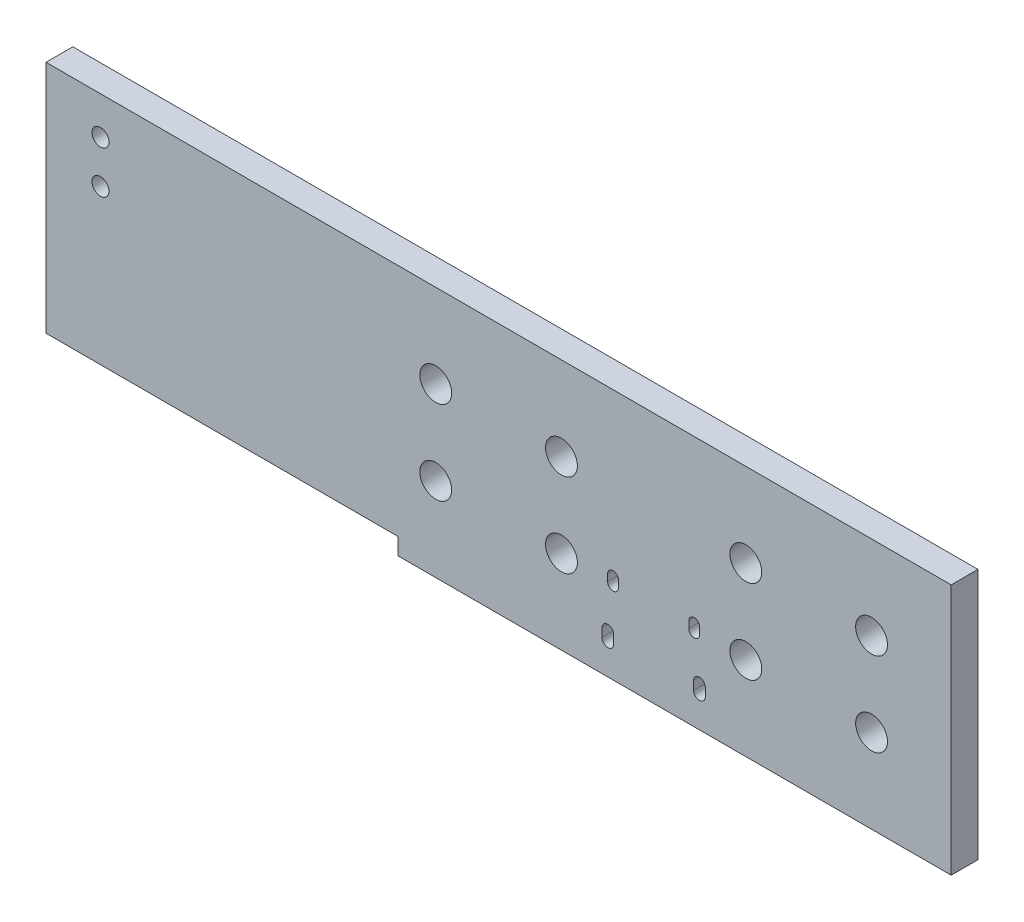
ISO-10303-21;
HEADER;
FILE_DESCRIPTION(('STEP AP214'),'2;1');
FILE_NAME('part.step','',(''),(''),'','','');
FILE_SCHEMA(('AUTOMOTIVE_DESIGN { 1 0 10303 214 1 1 1 1 }'));
ENDSEC;
DATA;
#1=APPLICATION_CONTEXT('core data for automotive mechanical design processes');
#2=APPLICATION_PROTOCOL_DEFINITION('international standard','automotive_design',2000,#1);
#3=PRODUCT_CONTEXT('',#1,'mechanical');
#4=PRODUCT('Part','Part','',(#3));
#5=PRODUCT_RELATED_PRODUCT_CATEGORY('part','',(#4));
#6=PRODUCT_DEFINITION_FORMATION('','',#4);
#7=PRODUCT_DEFINITION_CONTEXT('part definition',#1,'design');
#8=PRODUCT_DEFINITION('design','',#6,#7);
#9=PRODUCT_DEFINITION_SHAPE('','',#8);
#10=(LENGTH_UNIT() NAMED_UNIT(*) SI_UNIT(.MILLI.,.METRE.));
#11=(NAMED_UNIT(*) PLANE_ANGLE_UNIT() SI_UNIT($,.RADIAN.));
#12=(NAMED_UNIT(*) SI_UNIT($,.STERADIAN.) SOLID_ANGLE_UNIT());
#13=UNCERTAINTY_MEASURE_WITH_UNIT(LENGTH_MEASURE(1.E-05),#10,'distance_accuracy_value','');
#14=(GEOMETRIC_REPRESENTATION_CONTEXT(3) GLOBAL_UNCERTAINTY_ASSIGNED_CONTEXT((#13)) GLOBAL_UNIT_ASSIGNED_CONTEXT((#10,
#11,#12)) REPRESENTATION_CONTEXT('',''));
#15=CARTESIAN_POINT('',(0.,0.,0.));
#16=DIRECTION('',(0.,0.,1.));
#17=DIRECTION('',(1.,0.,0.));
#18=AXIS2_PLACEMENT_3D('',#15,#16,#17);
#19=CARTESIAN_POINT('',(147.505,-109.93,0.));
#20=DIRECTION('',(-1.,0.,0.));
#21=DIRECTION('',(0.,-1.,0.));
#22=AXIS2_PLACEMENT_3D('',#19,#20,#21);
#23=PLANE('',#22);
#24=DIRECTION('',(0.,0.,1.));
#25=VECTOR('',#24,1.);
#26=CARTESIAN_POINT('',(147.505,-110.33,0.));
#27=LINE('',#26,#25);
#28=CARTESIAN_POINT('',(147.505,-110.33,0.));
#29=VERTEX_POINT('',#28);
#30=CARTESIAN_POINT('',(147.505,-110.33,-1.6));
#31=VERTEX_POINT('',#30);
#32=EDGE_CURVE('E141',#29,#31,#27,.F.);
#33=ORIENTED_EDGE('',*,*,#32,.T.);
#34=DIRECTION('',(0.,-1.,0.));
#35=VECTOR('',#34,1.);
#36=CARTESIAN_POINT('',(147.505,-109.93,-1.6));
#37=LINE('',#36,#35);
#38=CARTESIAN_POINT('',(147.505,-109.93,-1.6));
#39=VERTEX_POINT('',#38);
#40=EDGE_CURVE('E163',#39,#31,#37,.T.);
#41=ORIENTED_EDGE('',*,*,#40,.F.);
#42=DIRECTION('',(0.,0.,1.));
#43=VECTOR('',#42,1.);
#44=CARTESIAN_POINT('',(147.505,-109.93,0.));
#45=LINE('',#44,#43);
#46=CARTESIAN_POINT('',(147.505,-109.93,0.));
#47=VERTEX_POINT('',#46);
#48=EDGE_CURVE('E124',#39,#47,#45,.T.);
#49=ORIENTED_EDGE('',*,*,#48,.T.);
#50=DIRECTION('',(0.,-1.,0.));
#51=VECTOR('',#50,1.);
#52=CARTESIAN_POINT('',(147.505,-109.93,0.));
#53=LINE('',#52,#51);
#54=EDGE_CURVE('E156',#29,#47,#53,.F.);
#55=ORIENTED_EDGE('',*,*,#54,.F.);
#56=EDGE_LOOP('',(#33,#41,#49,#55));
#57=FACE_BOUND('',#56,.T.);
#58=ADVANCED_FACE('F16',(#57),#23,.F.);
#59=CARTESIAN_POINT('',(153.33,-113.38,0.));
#60=DIRECTION('',(1.,0.,0.));
#61=DIRECTION('',(0.,1.,0.));
#62=AXIS2_PLACEMENT_3D('',#59,#60,#61);
#63=PLANE('',#62);
#64=DIRECTION('',(0.,0.,1.));
#65=VECTOR('',#64,1.);
#66=CARTESIAN_POINT('',(153.33,-112.88,0.));
#67=LINE('',#66,#65);
#68=CARTESIAN_POINT('',(153.33,-112.88,0.));
#69=VERTEX_POINT('',#68);
#70=CARTESIAN_POINT('',(153.33,-112.88,-1.6));
#71=VERTEX_POINT('',#70);
#72=EDGE_CURVE('E150',#69,#71,#67,.F.);
#73=ORIENTED_EDGE('',*,*,#72,.T.);
#74=DIRECTION('',(0.,1.,0.));
#75=VECTOR('',#74,1.);
#76=CARTESIAN_POINT('',(153.33,-113.38,-1.6));
#77=LINE('',#76,#75);
#78=CARTESIAN_POINT('',(153.33,-113.38,-1.6));
#79=VERTEX_POINT('',#78);
#80=EDGE_CURVE('E153',#79,#71,#77,.T.);
#81=ORIENTED_EDGE('',*,*,#80,.F.);
#82=DIRECTION('',(0.,0.,1.));
#83=VECTOR('',#82,1.);
#84=CARTESIAN_POINT('',(153.33,-113.38,0.));
#85=LINE('',#84,#83);
#86=CARTESIAN_POINT('',(153.33,-113.38,0.));
#87=VERTEX_POINT('',#86);
#88=EDGE_CURVE('E147',#79,#87,#85,.T.);
#89=ORIENTED_EDGE('',*,*,#88,.T.);
#90=DIRECTION('',(0.,1.,0.));
#91=VECTOR('',#90,1.);
#92=CARTESIAN_POINT('',(153.33,-113.38,0.));
#93=LINE('',#92,#91);
#94=EDGE_CURVE('E144',#69,#87,#93,.F.);
#95=ORIENTED_EDGE('',*,*,#94,.F.);
#96=EDGE_LOOP('',(#73,#81,#89,#95));
#97=FACE_BOUND('',#96,.T.);
#98=ADVANCED_FACE('F437',(#97),#63,.F.);
#99=CARTESIAN_POINT('',(147.87,-113.38,0.));
#100=DIRECTION('',(1.,0.,0.));
#101=DIRECTION('',(0.,1.,0.));
#102=AXIS2_PLACEMENT_3D('',#99,#100,#101);
#103=PLANE('',#102);
#104=DIRECTION('',(0.,0.,1.));
#105=VECTOR('',#104,1.);
#106=CARTESIAN_POINT('',(147.87,-112.88,0.));
#107=LINE('',#106,#105);
#108=CARTESIAN_POINT('',(147.87,-112.88,0.));
#109=VERTEX_POINT('',#108);
#110=CARTESIAN_POINT('',(147.87,-112.88,-1.6));
#111=VERTEX_POINT('',#110);
#112=EDGE_CURVE('E137',#109,#111,#107,.F.);
#113=ORIENTED_EDGE('',*,*,#112,.T.);
#114=DIRECTION('',(0.,1.,0.));
#115=VECTOR('',#114,1.);
#116=CARTESIAN_POINT('',(147.87,-113.38,-1.6));
#117=LINE('',#116,#115);
#118=CARTESIAN_POINT('',(147.87,-113.38,-1.6));
#119=VERTEX_POINT('',#118);
#120=EDGE_CURVE('E142',#119,#111,#117,.T.);
#121=ORIENTED_EDGE('',*,*,#120,.F.);
#122=DIRECTION('',(0.,0.,1.));
#123=VECTOR('',#122,1.);
#124=CARTESIAN_POINT('',(147.87,-113.38,0.));
#125=LINE('',#124,#123);
#126=CARTESIAN_POINT('',(147.87,-113.38,0.));
#127=VERTEX_POINT('',#126);
#128=EDGE_CURVE('E133',#119,#127,#125,.T.);
#129=ORIENTED_EDGE('',*,*,#128,.T.);
#130=DIRECTION('',(0.,1.,0.));
#131=VECTOR('',#130,1.);
#132=CARTESIAN_POINT('',(147.87,-113.38,0.));
#133=LINE('',#132,#131);
#134=EDGE_CURVE('E138',#109,#127,#133,.F.);
#135=ORIENTED_EDGE('',*,*,#134,.F.);
#136=EDGE_LOOP('',(#113,#121,#129,#135));
#137=FACE_BOUND('',#136,.T.);
#138=ADVANCED_FACE('F456',(#137),#103,.F.);
#139=CARTESIAN_POINT('',(152.995,-110.33,0.));
#140=DIRECTION('',(1.,0.,0.));
#141=DIRECTION('',(0.,1.,0.));
#142=AXIS2_PLACEMENT_3D('',#139,#140,#141);
#143=PLANE('',#142);
#144=DIRECTION('',(0.,0.,1.));
#145=VECTOR('',#144,1.);
#146=CARTESIAN_POINT('',(152.995,-109.93,0.));
#147=LINE('',#146,#145);
#148=CARTESIAN_POINT('',(152.995,-109.93,0.));
#149=VERTEX_POINT('',#148);
#150=CARTESIAN_POINT('',(152.995,-109.93,-1.6));
#151=VERTEX_POINT('',#150);
#152=EDGE_CURVE('E128',#149,#151,#147,.F.);
#153=ORIENTED_EDGE('',*,*,#152,.T.);
#154=DIRECTION('',(0.,1.,0.));
#155=VECTOR('',#154,1.);
#156=CARTESIAN_POINT('',(152.995,-110.33,-1.6));
#157=LINE('',#156,#155);
#158=CARTESIAN_POINT('',(152.995,-110.33,-1.6));
#159=VERTEX_POINT('',#158);
#160=EDGE_CURVE('E113',#159,#151,#157,.T.);
#161=ORIENTED_EDGE('',*,*,#160,.F.);
#162=DIRECTION('',(0.,0.,1.));
#163=VECTOR('',#162,1.);
#164=CARTESIAN_POINT('',(152.995,-110.33,0.));
#165=LINE('',#164,#163);
#166=CARTESIAN_POINT('',(152.995,-110.33,0.));
#167=VERTEX_POINT('',#166);
#168=EDGE_CURVE('E120',#167,#159,#165,.F.);
#169=ORIENTED_EDGE('',*,*,#168,.F.);
#170=DIRECTION('',(0.,1.,0.));
#171=VECTOR('',#170,1.);
#172=CARTESIAN_POINT('',(152.995,-110.33,0.));
#173=LINE('',#172,#171);
#174=EDGE_CURVE('E118',#149,#167,#173,.F.);
#175=ORIENTED_EDGE('',*,*,#174,.F.);
#176=EDGE_LOOP('',(#153,#161,#169,#175));
#177=FACE_BOUND('',#176,.T.);
#178=ADVANCED_FACE('F126',(#177),#143,.F.);
#179=CARTESIAN_POINT('',(152.67,-110.33,0.));
#180=DIRECTION('',(0.,0.,1.));
#181=DIRECTION('',(1.,0.,0.));
#182=AXIS2_PLACEMENT_3D('',#179,#180,#181);
#183=CYLINDRICAL_SURFACE('',#182,0.325);
#184=CARTESIAN_POINT('',(152.67,-110.33,0.));
#185=DIRECTION('',(0.,0.,1.));
#186=DIRECTION('',(1.,0.,0.));
#187=AXIS2_PLACEMENT_3D('',#184,#185,#186);
#188=CIRCLE('',#187,0.325);
#189=CARTESIAN_POINT('',(152.345,-110.33,0.));
#190=VERTEX_POINT('',#189);
#191=EDGE_CURVE('E103',#167,#190,#188,.F.);
#192=ORIENTED_EDGE('',*,*,#191,.F.);
#193=ORIENTED_EDGE('',*,*,#168,.T.);
#194=CARTESIAN_POINT('',(152.67,-110.33,-1.6));
#195=DIRECTION('',(0.,0.,1.));
#196=DIRECTION('',(1.,0.,0.));
#197=AXIS2_PLACEMENT_3D('',#194,#195,#196);
#198=CIRCLE('',#197,0.325);
#199=CARTESIAN_POINT('',(152.345,-110.33,-1.6));
#200=VERTEX_POINT('',#199);
#201=EDGE_CURVE('E19',#200,#159,#198,.T.);
#202=ORIENTED_EDGE('',*,*,#201,.F.);
#203=DIRECTION('',(0.,0.,1.));
#204=VECTOR('',#203,1.);
#205=CARTESIAN_POINT('',(152.345,-110.33,0.));
#206=LINE('',#205,#204);
#207=EDGE_CURVE('E263',#200,#190,#206,.T.);
#208=ORIENTED_EDGE('',*,*,#207,.T.);
#209=EDGE_LOOP('',(#192,#193,#202,#208));
#210=FACE_BOUND('',#209,.T.);
#211=ADVANCED_FACE('F121',(#210),#183,.F.);
#212=CARTESIAN_POINT('',(147.83,-110.33,0.));
#213=DIRECTION('',(0.,0.,1.));
#214=DIRECTION('',(1.,0.,0.));
#215=AXIS2_PLACEMENT_3D('',#212,#213,#214);
#216=CYLINDRICAL_SURFACE('',#215,0.325);
#217=DIRECTION('',(0.,0.,1.));
#218=VECTOR('',#217,1.);
#219=CARTESIAN_POINT('',(148.155,-110.33,0.));
#220=LINE('',#219,#218);
#221=CARTESIAN_POINT('',(148.155,-110.33,0.));
#222=VERTEX_POINT('',#221);
#223=CARTESIAN_POINT('',(148.155,-110.33,-1.6));
#224=VERTEX_POINT('',#223);
#225=EDGE_CURVE('E237',#222,#224,#220,.F.);
#226=ORIENTED_EDGE('',*,*,#225,.T.);
#227=CARTESIAN_POINT('',(147.83,-110.33,-1.6));
#228=DIRECTION('',(0.,0.,1.));
#229=DIRECTION('',(1.,0.,0.));
#230=AXIS2_PLACEMENT_3D('',#227,#228,#229);
#231=CIRCLE('',#230,0.325);
#232=EDGE_CURVE('E136',#31,#224,#231,.T.);
#233=ORIENTED_EDGE('',*,*,#232,.F.);
#234=ORIENTED_EDGE('',*,*,#32,.F.);
#235=CARTESIAN_POINT('',(147.83,-110.33,0.));
#236=DIRECTION('',(0.,0.,1.));
#237=DIRECTION('',(1.,0.,0.));
#238=AXIS2_PLACEMENT_3D('',#235,#236,#237);
#239=CIRCLE('',#238,0.325);
#240=EDGE_CURVE('E251',#29,#222,#239,.T.);
#241=ORIENTED_EDGE('',*,*,#240,.T.);
#242=EDGE_LOOP('',(#226,#233,#234,#241));
#243=FACE_BOUND('',#242,.T.);
#244=ADVANCED_FACE('F387',(#243),#216,.F.);
#245=CARTESIAN_POINT('',(147.83,-109.93,0.));
#246=DIRECTION('',(0.,0.,1.));
#247=DIRECTION('',(1.,0.,0.));
#248=AXIS2_PLACEMENT_3D('',#245,#246,#247);
#249=CYLINDRICAL_SURFACE('',#248,0.325);
#250=CARTESIAN_POINT('',(147.83,-109.93,0.));
#251=DIRECTION('',(0.,0.,1.));
#252=DIRECTION('',(1.,0.,0.));
#253=AXIS2_PLACEMENT_3D('',#250,#251,#252);
#254=CIRCLE('',#253,0.325);
#255=CARTESIAN_POINT('',(148.155,-109.93,0.));
#256=VERTEX_POINT('',#255);
#257=EDGE_CURVE('E254',#256,#47,#254,.T.);
#258=ORIENTED_EDGE('',*,*,#257,.T.);
#259=ORIENTED_EDGE('',*,*,#48,.F.);
#260=CARTESIAN_POINT('',(147.83,-109.93,-1.6));
#261=DIRECTION('',(0.,0.,1.));
#262=DIRECTION('',(1.,0.,0.));
#263=AXIS2_PLACEMENT_3D('',#260,#261,#262);
#264=CIRCLE('',#263,0.325);
#265=CARTESIAN_POINT('',(148.155,-109.93,-1.6));
#266=VERTEX_POINT('',#265);
#267=EDGE_CURVE('E264',#266,#39,#264,.T.);
#268=ORIENTED_EDGE('',*,*,#267,.F.);
#269=DIRECTION('',(0.,0.,1.));
#270=VECTOR('',#269,1.);
#271=CARTESIAN_POINT('',(148.155,-109.93,0.));
#272=LINE('',#271,#270);
#273=EDGE_CURVE('E293',#266,#256,#272,.T.);
#274=ORIENTED_EDGE('',*,*,#273,.T.);
#275=EDGE_LOOP('',(#258,#259,#268,#274));
#276=FACE_BOUND('',#275,.T.);
#277=ADVANCED_FACE('F394',(#276),#249,.F.);
#278=CARTESIAN_POINT('',(152.345,-109.93,0.));
#279=DIRECTION('',(-1.,0.,0.));
#280=DIRECTION('',(0.,-1.,0.));
#281=AXIS2_PLACEMENT_3D('',#278,#279,#280);
#282=PLANE('',#281);
#283=ORIENTED_EDGE('',*,*,#207,.F.);
#284=DIRECTION('',(0.,-1.,0.));
#285=VECTOR('',#284,1.);
#286=CARTESIAN_POINT('',(152.345,-109.93,-1.6));
#287=LINE('',#286,#285);
#288=CARTESIAN_POINT('',(152.345,-109.93,-1.6));
#289=VERTEX_POINT('',#288);
#290=EDGE_CURVE('E116',#289,#200,#287,.T.);
#291=ORIENTED_EDGE('',*,*,#290,.F.);
#292=DIRECTION('',(0.,0.,1.));
#293=VECTOR('',#292,1.);
#294=CARTESIAN_POINT('',(152.345,-109.93,0.));
#295=LINE('',#294,#293);
#296=CARTESIAN_POINT('',(152.345,-109.93,0.));
#297=VERTEX_POINT('',#296);
#298=EDGE_CURVE('E233',#289,#297,#295,.T.);
#299=ORIENTED_EDGE('',*,*,#298,.T.);
#300=DIRECTION('',(0.,1.,0.));
#301=VECTOR('',#300,1.);
#302=CARTESIAN_POINT('',(152.345,-115.25,0.));
#303=LINE('',#302,#301);
#304=EDGE_CURVE('E250',#297,#190,#303,.F.);
#305=ORIENTED_EDGE('',*,*,#304,.T.);
#306=EDGE_LOOP('',(#283,#291,#299,#305));
#307=FACE_BOUND('',#306,.T.);
#308=ADVANCED_FACE('F275',(#307),#282,.F.);
#309=CARTESIAN_POINT('',(152.98,-112.88,0.));
#310=DIRECTION('',(0.,0.,1.));
#311=DIRECTION('',(1.,0.,0.));
#312=AXIS2_PLACEMENT_3D('',#309,#310,#311);
#313=CYLINDRICAL_SURFACE('',#312,0.35);
#314=DIRECTION('',(0.,0.,1.));
#315=VECTOR('',#314,1.);
#316=CARTESIAN_POINT('',(152.63,-112.88,0.));
#317=LINE('',#316,#315);
#318=CARTESIAN_POINT('',(152.63,-112.88,0.));
#319=VERTEX_POINT('',#318);
#320=CARTESIAN_POINT('',(152.63,-112.88,-1.6));
#321=VERTEX_POINT('',#320);
#322=EDGE_CURVE('E226',#319,#321,#317,.F.);
#323=ORIENTED_EDGE('',*,*,#322,.T.);
#324=CARTESIAN_POINT('',(152.98,-112.88,-1.6));
#325=DIRECTION('',(0.,0.,1.));
#326=DIRECTION('',(1.,0.,0.));
#327=AXIS2_PLACEMENT_3D('',#324,#325,#326);
#328=CIRCLE('',#327,0.35);
#329=EDGE_CURVE('E261',#71,#321,#328,.T.);
#330=ORIENTED_EDGE('',*,*,#329,.F.);
#331=ORIENTED_EDGE('',*,*,#72,.F.);
#332=CARTESIAN_POINT('',(152.98,-112.88,0.));
#333=DIRECTION('',(0.,0.,1.));
#334=DIRECTION('',(1.,0.,0.));
#335=AXIS2_PLACEMENT_3D('',#332,#333,#334);
#336=CIRCLE('',#335,0.35);
#337=EDGE_CURVE('E245',#69,#319,#336,.T.);
#338=ORIENTED_EDGE('',*,*,#337,.T.);
#339=EDGE_LOOP('',(#323,#330,#331,#338));
#340=FACE_BOUND('',#339,.T.);
#341=ADVANCED_FACE('F434',(#340),#313,.F.);
#342=CARTESIAN_POINT('',(152.98,-113.38,0.));
#343=DIRECTION('',(0.,0.,1.));
#344=DIRECTION('',(1.,0.,0.));
#345=AXIS2_PLACEMENT_3D('',#342,#343,#344);
#346=CYLINDRICAL_SURFACE('',#345,0.35);
#347=CARTESIAN_POINT('',(152.98,-113.38,0.));
#348=DIRECTION('',(0.,0.,1.));
#349=DIRECTION('',(1.,0.,0.));
#350=AXIS2_PLACEMENT_3D('',#347,#348,#349);
#351=CIRCLE('',#350,0.35);
#352=CARTESIAN_POINT('',(152.63,-113.38,0.));
#353=VERTEX_POINT('',#352);
#354=EDGE_CURVE('E248',#353,#87,#351,.T.);
#355=ORIENTED_EDGE('',*,*,#354,.T.);
#356=ORIENTED_EDGE('',*,*,#88,.F.);
#357=CARTESIAN_POINT('',(152.98,-113.38,-1.6));
#358=DIRECTION('',(0.,0.,1.));
#359=DIRECTION('',(1.,0.,0.));
#360=AXIS2_PLACEMENT_3D('',#357,#358,#359);
#361=CIRCLE('',#360,0.35);
#362=CARTESIAN_POINT('',(152.63,-113.38,-1.6));
#363=VERTEX_POINT('',#362);
#364=EDGE_CURVE('E259',#363,#79,#361,.T.);
#365=ORIENTED_EDGE('',*,*,#364,.F.);
#366=DIRECTION('',(0.,0.,1.));
#367=VECTOR('',#366,1.);
#368=CARTESIAN_POINT('',(152.63,-113.38,0.));
#369=LINE('',#368,#367);
#370=EDGE_CURVE('E288',#363,#353,#369,.T.);
#371=ORIENTED_EDGE('',*,*,#370,.T.);
#372=EDGE_LOOP('',(#355,#356,#365,#371));
#373=FACE_BOUND('',#372,.T.);
#374=ADVANCED_FACE('F422',(#373),#346,.F.);
#375=CARTESIAN_POINT('',(147.52,-112.88,0.));
#376=DIRECTION('',(0.,0.,1.));
#377=DIRECTION('',(1.,0.,0.));
#378=AXIS2_PLACEMENT_3D('',#375,#376,#377);
#379=CYLINDRICAL_SURFACE('',#378,0.35);
#380=DIRECTION('',(0.,0.,1.));
#381=VECTOR('',#380,1.);
#382=CARTESIAN_POINT('',(147.17,-112.88,0.));
#383=LINE('',#382,#381);
#384=CARTESIAN_POINT('',(147.17,-112.88,0.));
#385=VERTEX_POINT('',#384);
#386=CARTESIAN_POINT('',(147.17,-112.88,-1.6));
#387=VERTEX_POINT('',#386);
#388=EDGE_CURVE('E287',#385,#387,#383,.F.);
#389=ORIENTED_EDGE('',*,*,#388,.T.);
#390=CARTESIAN_POINT('',(147.52,-112.88,-1.6));
#391=DIRECTION('',(0.,0.,1.));
#392=DIRECTION('',(1.,0.,0.));
#393=AXIS2_PLACEMENT_3D('',#390,#391,#392);
#394=CIRCLE('',#393,0.35);
#395=EDGE_CURVE('E34',#111,#387,#394,.T.);
#396=ORIENTED_EDGE('',*,*,#395,.F.);
#397=ORIENTED_EDGE('',*,*,#112,.F.);
#398=CARTESIAN_POINT('',(147.52,-112.88,0.));
#399=DIRECTION('',(0.,0.,1.));
#400=DIRECTION('',(1.,0.,0.));
#401=AXIS2_PLACEMENT_3D('',#398,#399,#400);
#402=CIRCLE('',#401,0.35);
#403=EDGE_CURVE('E239',#109,#385,#402,.T.);
#404=ORIENTED_EDGE('',*,*,#403,.T.);
#405=EDGE_LOOP('',(#389,#396,#397,#404));
#406=FACE_BOUND('',#405,.T.);
#407=ADVANCED_FACE('F458',(#406),#379,.F.);
#408=CARTESIAN_POINT('',(147.52,-113.38,0.));
#409=DIRECTION('',(0.,0.,1.));
#410=DIRECTION('',(1.,0.,0.));
#411=AXIS2_PLACEMENT_3D('',#408,#409,#410);
#412=CYLINDRICAL_SURFACE('',#411,0.35);
#413=CARTESIAN_POINT('',(147.52,-113.38,0.));
#414=DIRECTION('',(0.,0.,1.));
#415=DIRECTION('',(1.,0.,0.));
#416=AXIS2_PLACEMENT_3D('',#413,#414,#415);
#417=CIRCLE('',#416,0.35);
#418=CARTESIAN_POINT('',(147.17,-113.38,0.));
#419=VERTEX_POINT('',#418);
#420=EDGE_CURVE('E243',#419,#127,#417,.T.);
#421=ORIENTED_EDGE('',*,*,#420,.T.);
#422=ORIENTED_EDGE('',*,*,#128,.F.);
#423=CARTESIAN_POINT('',(147.52,-113.38,-1.6));
#424=DIRECTION('',(0.,0.,1.));
#425=DIRECTION('',(1.,0.,0.));
#426=AXIS2_PLACEMENT_3D('',#423,#424,#425);
#427=CIRCLE('',#426,0.35);
#428=CARTESIAN_POINT('',(147.17,-113.38,-1.6));
#429=VERTEX_POINT('',#428);
#430=EDGE_CURVE('E256',#429,#119,#427,.T.);
#431=ORIENTED_EDGE('',*,*,#430,.F.);
#432=DIRECTION('',(0.,0.,1.));
#433=VECTOR('',#432,1.);
#434=CARTESIAN_POINT('',(147.17,-113.38,0.));
#435=LINE('',#434,#433);
#436=EDGE_CURVE('E283',#429,#419,#435,.T.);
#437=ORIENTED_EDGE('',*,*,#436,.T.);
#438=EDGE_LOOP('',(#421,#422,#431,#437));
#439=FACE_BOUND('',#438,.T.);
#440=ADVANCED_FACE('F450',(#439),#412,.F.);
#441=CARTESIAN_POINT('',(135.,-115.25,0.));
#442=DIRECTION('',(0.,0.,-1.));
#443=DIRECTION('',(-1.,0.,0.));
#444=AXIS2_PLACEMENT_3D('',#441,#442,#443);
#445=PLANE('',#444);
#446=CARTESIAN_POINT('',(137.25,-110.25,0.));
#447=DIRECTION('',(0.,0.,1.));
#448=DIRECTION('',(1.,0.,0.));
#449=AXIS2_PLACEMENT_3D('',#446,#447,#448);
#450=CIRCLE('',#449,0.95);
#451=CARTESIAN_POINT('',(138.2,-110.25,0.));
#452=VERTEX_POINT('',#451);
#453=EDGE_CURVE('E200',#452,#452,#450,.F.);
#454=ORIENTED_EDGE('',*,*,#453,.T.);
#455=EDGE_LOOP('',(#454));
#456=FACE_BOUND('',#455,.T.);
#457=CARTESIAN_POINT('',(137.25,-105.25,0.));
#458=DIRECTION('',(0.,0.,1.));
#459=DIRECTION('',(1.,0.,0.));
#460=AXIS2_PLACEMENT_3D('',#457,#458,#459);
#461=CIRCLE('',#460,0.95);
#462=CARTESIAN_POINT('',(138.2,-105.25,0.));
#463=VERTEX_POINT('',#462);
#464=EDGE_CURVE('E204',#463,#463,#461,.F.);
#465=ORIENTED_EDGE('',*,*,#464,.T.);
#466=EDGE_LOOP('',(#465));
#467=FACE_BOUND('',#466,.T.);
#468=CARTESIAN_POINT('',(117.25,-105.04,0.));
#469=DIRECTION('',(0.,0.,1.));
#470=DIRECTION('',(1.,0.,0.));
#471=AXIS2_PLACEMENT_3D('',#468,#469,#470);
#472=CIRCLE('',#471,0.508);
#473=CARTESIAN_POINT('',(117.758,-105.04,0.));
#474=VERTEX_POINT('',#473);
#475=EDGE_CURVE('E207',#474,#474,#472,.F.);
#476=ORIENTED_EDGE('',*,*,#475,.T.);
#477=EDGE_LOOP('',(#476));
#478=FACE_BOUND('',#477,.T.);
#479=CARTESIAN_POINT('',(117.25,-102.5,0.));
#480=DIRECTION('',(0.,0.,1.));
#481=DIRECTION('',(1.,0.,0.));
#482=AXIS2_PLACEMENT_3D('',#479,#480,#481);
#483=CIRCLE('',#482,0.508);
#484=CARTESIAN_POINT('',(117.758,-102.5,0.));
#485=VERTEX_POINT('',#484);
#486=EDGE_CURVE('E210',#485,#485,#483,.F.);
#487=ORIENTED_EDGE('',*,*,#486,.T.);
#488=EDGE_LOOP('',(#487));
#489=FACE_BOUND('',#488,.T.);
#490=CARTESIAN_POINT('',(155.75,-105.25,0.));
#491=DIRECTION('',(0.,0.,1.));
#492=DIRECTION('',(1.,0.,0.));
#493=AXIS2_PLACEMENT_3D('',#490,#491,#492);
#494=CIRCLE('',#493,0.95);
#495=CARTESIAN_POINT('',(156.7,-105.25,0.));
#496=VERTEX_POINT('',#495);
#497=EDGE_CURVE('E213',#496,#496,#494,.F.);
#498=ORIENTED_EDGE('',*,*,#497,.T.);
#499=EDGE_LOOP('',(#498));
#500=FACE_BOUND('',#499,.T.);
#501=CARTESIAN_POINT('',(163.25,-105.25,0.));
#502=DIRECTION('',(0.,0.,1.));
#503=DIRECTION('',(1.,0.,0.));
#504=AXIS2_PLACEMENT_3D('',#501,#502,#503);
#505=CIRCLE('',#504,0.95);
#506=CARTESIAN_POINT('',(164.2,-105.25,0.));
#507=VERTEX_POINT('',#506);
#508=EDGE_CURVE('E216',#507,#507,#505,.F.);
#509=ORIENTED_EDGE('',*,*,#508,.T.);
#510=EDGE_LOOP('',(#509));
#511=FACE_BOUND('',#510,.T.);
#512=CARTESIAN_POINT('',(144.75,-105.25,0.));
#513=DIRECTION('',(0.,0.,1.));
#514=DIRECTION('',(1.,0.,0.));
#515=AXIS2_PLACEMENT_3D('',#512,#513,#514);
#516=CIRCLE('',#515,0.95);
#517=CARTESIAN_POINT('',(145.7,-105.25,0.));
#518=VERTEX_POINT('',#517);
#519=EDGE_CURVE('E219',#518,#518,#516,.F.);
#520=ORIENTED_EDGE('',*,*,#519,.T.);
#521=EDGE_LOOP('',(#520));
#522=FACE_BOUND('',#521,.T.);
#523=ORIENTED_EDGE('',*,*,#403,.F.);
#524=ORIENTED_EDGE('',*,*,#134,.T.);
#525=ORIENTED_EDGE('',*,*,#420,.F.);
#526=DIRECTION('',(0.,-1.,0.));
#527=VECTOR('',#526,1.);
#528=CARTESIAN_POINT('',(147.17,-112.88,0.));
#529=LINE('',#528,#527);
#530=EDGE_CURVE('E222',#419,#385,#529,.F.);
#531=ORIENTED_EDGE('',*,*,#530,.T.);
#532=EDGE_LOOP('',(#523,#524,#525,#531));
#533=FACE_BOUND('',#532,.T.);
#534=ORIENTED_EDGE('',*,*,#337,.F.);
#535=ORIENTED_EDGE('',*,*,#94,.T.);
#536=ORIENTED_EDGE('',*,*,#354,.F.);
#537=DIRECTION('',(0.,-1.,0.));
#538=VECTOR('',#537,1.);
#539=CARTESIAN_POINT('',(152.63,-112.88,0.));
#540=LINE('',#539,#538);
#541=EDGE_CURVE('E284',#353,#319,#540,.F.);
#542=ORIENTED_EDGE('',*,*,#541,.T.);
#543=EDGE_LOOP('',(#534,#535,#536,#542));
#544=FACE_BOUND('',#543,.T.);
#545=CARTESIAN_POINT('',(155.75,-110.25,0.));
#546=DIRECTION('',(0.,0.,1.));
#547=DIRECTION('',(1.,0.,0.));
#548=AXIS2_PLACEMENT_3D('',#545,#546,#547);
#549=CIRCLE('',#548,0.95);
#550=CARTESIAN_POINT('',(156.7,-110.25,0.));
#551=VERTEX_POINT('',#550);
#552=EDGE_CURVE('E223',#551,#551,#549,.F.);
#553=ORIENTED_EDGE('',*,*,#552,.T.);
#554=EDGE_LOOP('',(#553));
#555=FACE_BOUND('',#554,.T.);
#556=CARTESIAN_POINT('',(163.25,-110.25,0.));
#557=DIRECTION('',(0.,0.,1.));
#558=DIRECTION('',(1.,0.,0.));
#559=AXIS2_PLACEMENT_3D('',#556,#557,#558);
#560=CIRCLE('',#559,0.95);
#561=CARTESIAN_POINT('',(164.2,-110.25,0.));
#562=VERTEX_POINT('',#561);
#563=EDGE_CURVE('E227',#562,#562,#560,.F.);
#564=ORIENTED_EDGE('',*,*,#563,.T.);
#565=EDGE_LOOP('',(#564));
#566=FACE_BOUND('',#565,.T.);
#567=CARTESIAN_POINT('',(152.67,-109.93,0.));
#568=DIRECTION('',(0.,0.,1.));
#569=DIRECTION('',(1.,0.,0.));
#570=AXIS2_PLACEMENT_3D('',#567,#568,#569);
#571=CIRCLE('',#570,0.325);
#572=EDGE_CURVE('E230',#297,#149,#571,.F.);
#573=ORIENTED_EDGE('',*,*,#572,.T.);
#574=ORIENTED_EDGE('',*,*,#174,.T.);
#575=ORIENTED_EDGE('',*,*,#191,.T.);
#576=ORIENTED_EDGE('',*,*,#304,.F.);
#577=EDGE_LOOP('',(#573,#574,#575,#576));
#578=FACE_BOUND('',#577,.T.);
#579=ORIENTED_EDGE('',*,*,#240,.F.);
#580=ORIENTED_EDGE('',*,*,#54,.T.);
#581=ORIENTED_EDGE('',*,*,#257,.F.);
#582=DIRECTION('',(0.,1.,0.));
#583=VECTOR('',#582,1.);
#584=CARTESIAN_POINT('',(148.155,-110.33,0.));
#585=LINE('',#584,#583);
#586=EDGE_CURVE('E290',#256,#222,#585,.F.);
#587=ORIENTED_EDGE('',*,*,#586,.T.);
#588=EDGE_LOOP('',(#579,#580,#581,#587));
#589=FACE_BOUND('',#588,.T.);
#590=CARTESIAN_POINT('',(144.75,-110.25,0.));
#591=DIRECTION('',(0.,0.,1.));
#592=DIRECTION('',(1.,0.,0.));
#593=AXIS2_PLACEMENT_3D('',#590,#591,#592);
#594=CIRCLE('',#593,0.95);
#595=CARTESIAN_POINT('',(145.7,-110.25,0.));
#596=VERTEX_POINT('',#595);
#597=EDGE_CURVE('E234',#596,#596,#594,.F.);
#598=ORIENTED_EDGE('',*,*,#597,.T.);
#599=EDGE_LOOP('',(#598));
#600=FACE_BOUND('',#599,.T.);
#601=DIRECTION('',(0.,1.,0.));
#602=VECTOR('',#601,1.);
#603=CARTESIAN_POINT('',(168.,-115.25,0.));
#604=LINE('',#603,#602);
#605=CARTESIAN_POINT('',(168.,-100.25,0.));
#606=VERTEX_POINT('',#605);
#607=CARTESIAN_POINT('',(168.,-115.25,0.));
#608=VERTEX_POINT('',#607);
#609=EDGE_CURVE('E312',#606,#608,#604,.F.);
#610=ORIENTED_EDGE('',*,*,#609,.F.);
#611=DIRECTION('',(1.,0.,0.));
#612=VECTOR('',#611,1.);
#613=CARTESIAN_POINT('',(168.,-100.25,0.));
#614=LINE('',#613,#612);
#615=CARTESIAN_POINT('',(114.,-100.25,0.));
#616=VERTEX_POINT('',#615);
#617=EDGE_CURVE('E318',#616,#606,#614,.T.);
#618=ORIENTED_EDGE('',*,*,#617,.F.);
#619=DIRECTION('',(0.,1.,0.));
#620=VECTOR('',#619,1.);
#621=CARTESIAN_POINT('',(114.,-100.25,0.));
#622=LINE('',#621,#620);
#623=CARTESIAN_POINT('',(114.,-114.25,0.));
#624=VERTEX_POINT('',#623);
#625=EDGE_CURVE('E324',#624,#616,#622,.T.);
#626=ORIENTED_EDGE('',*,*,#625,.F.);
#627=DIRECTION('',(1.,0.,0.));
#628=VECTOR('',#627,1.);
#629=CARTESIAN_POINT('',(114.,-114.25,0.));
#630=LINE('',#629,#628);
#631=CARTESIAN_POINT('',(135.,-114.25,0.));
#632=VERTEX_POINT('',#631);
#633=EDGE_CURVE('E330',#632,#624,#630,.F.);
#634=ORIENTED_EDGE('',*,*,#633,.F.);
#635=DIRECTION('',(0.,1.,0.));
#636=VECTOR('',#635,1.);
#637=CARTESIAN_POINT('',(135.,-114.25,0.));
#638=LINE('',#637,#636);
#639=CARTESIAN_POINT('',(135.,-115.25,0.));
#640=VERTEX_POINT('',#639);
#641=EDGE_CURVE('E335',#640,#632,#638,.T.);
#642=ORIENTED_EDGE('',*,*,#641,.F.);
#643=DIRECTION('',(1.,0.,0.));
#644=VECTOR('',#643,1.);
#645=CARTESIAN_POINT('',(154.,-115.25,0.));
#646=LINE('',#645,#644);
#647=EDGE_CURVE('E238',#608,#640,#646,.F.);
#648=ORIENTED_EDGE('',*,*,#647,.F.);
#649=EDGE_LOOP('',(#610,#618,#626,#634,#642,#648));
#650=FACE_BOUND('',#649,.T.);
#651=ADVANCED_FACE('F268',(#456,#467,#478,#489,#500,#511,#522,#533,#544,#555,#566,#578,#589,
#600,#650),#445,.F.);
#652=CARTESIAN_POINT('',(135.,-114.25,0.));
#653=DIRECTION('',(-1.,0.,0.));
#654=DIRECTION('',(0.,0.,1.));
#655=AXIS2_PLACEMENT_3D('',#652,#653,#654);
#656=PLANE('',#655);
#657=DIRECTION('',(0.,0.,1.));
#658=VECTOR('',#657,1.);
#659=CARTESIAN_POINT('',(135.,-115.25,0.));
#660=LINE('',#659,#658);
#661=CARTESIAN_POINT('',(135.,-115.25,-1.6));
#662=VERTEX_POINT('',#661);
#663=EDGE_CURVE('E242',#662,#640,#660,.T.);
#664=ORIENTED_EDGE('',*,*,#663,.T.);
#665=ORIENTED_EDGE('',*,*,#641,.T.);
#666=DIRECTION('',(0.,0.,-1.));
#667=VECTOR('',#666,1.);
#668=CARTESIAN_POINT('',(135.,-114.25,0.));
#669=LINE('',#668,#667);
#670=CARTESIAN_POINT('',(135.,-114.25,-1.6));
#671=VERTEX_POINT('',#670);
#672=EDGE_CURVE('E333',#671,#632,#669,.F.);
#673=ORIENTED_EDGE('',*,*,#672,.F.);
#674=DIRECTION('',(0.,1.,0.));
#675=VECTOR('',#674,1.);
#676=CARTESIAN_POINT('',(135.,-115.25,-1.6));
#677=LINE('',#676,#675);
#678=EDGE_CURVE('E349',#662,#671,#677,.T.);
#679=ORIENTED_EDGE('',*,*,#678,.F.);
#680=EDGE_LOOP('',(#664,#665,#673,#679));
#681=FACE_BOUND('',#680,.T.);
#682=ADVANCED_FACE('F346',(#681),#656,.T.);
#683=CARTESIAN_POINT('',(114.,-114.25,0.));
#684=DIRECTION('',(0.,-1.,0.));
#685=DIRECTION('',(0.,0.,-1.));
#686=AXIS2_PLACEMENT_3D('',#683,#684,#685);
#687=PLANE('',#686);
#688=ORIENTED_EDGE('',*,*,#672,.T.);
#689=ORIENTED_EDGE('',*,*,#633,.T.);
#690=DIRECTION('',(0.,0.,1.));
#691=VECTOR('',#690,1.);
#692=CARTESIAN_POINT('',(114.,-114.25,0.));
#693=LINE('',#692,#691);
#694=CARTESIAN_POINT('',(114.,-114.25,-1.6));
#695=VERTEX_POINT('',#694);
#696=EDGE_CURVE('E327',#695,#624,#693,.T.);
#697=ORIENTED_EDGE('',*,*,#696,.F.);
#698=DIRECTION('',(-1.,0.,0.));
#699=VECTOR('',#698,1.);
#700=CARTESIAN_POINT('',(135.,-114.25,-1.6));
#701=LINE('',#700,#699);
#702=EDGE_CURVE('E410',#671,#695,#701,.T.);
#703=ORIENTED_EDGE('',*,*,#702,.F.);
#704=EDGE_LOOP('',(#688,#689,#697,#703));
#705=FACE_BOUND('',#704,.T.);
#706=ADVANCED_FACE('F538',(#705),#687,.T.);
#707=CARTESIAN_POINT('',(114.,-100.25,0.));
#708=DIRECTION('',(-1.,0.,0.));
#709=DIRECTION('',(0.,0.,1.));
#710=AXIS2_PLACEMENT_3D('',#707,#708,#709);
#711=PLANE('',#710);
#712=ORIENTED_EDGE('',*,*,#696,.T.);
#713=ORIENTED_EDGE('',*,*,#625,.T.);
#714=DIRECTION('',(0.,0.,1.));
#715=VECTOR('',#714,1.);
#716=CARTESIAN_POINT('',(114.,-100.25,0.));
#717=LINE('',#716,#715);
#718=CARTESIAN_POINT('',(114.,-100.25,-1.6));
#719=VERTEX_POINT('',#718);
#720=EDGE_CURVE('E321',#719,#616,#717,.T.);
#721=ORIENTED_EDGE('',*,*,#720,.F.);
#722=DIRECTION('',(0.,1.,0.));
#723=VECTOR('',#722,1.);
#724=CARTESIAN_POINT('',(114.,-115.25,-1.6));
#725=LINE('',#724,#723);
#726=EDGE_CURVE('E407',#695,#719,#725,.T.);
#727=ORIENTED_EDGE('',*,*,#726,.F.);
#728=EDGE_LOOP('',(#712,#713,#721,#727));
#729=FACE_BOUND('',#728,.T.);
#730=ADVANCED_FACE('F534',(#729),#711,.T.);
#731=CARTESIAN_POINT('',(168.,-100.25,0.));
#732=DIRECTION('',(0.,1.,0.));
#733=DIRECTION('',(0.,0.,1.));
#734=AXIS2_PLACEMENT_3D('',#731,#732,#733);
#735=PLANE('',#734);
#736=ORIENTED_EDGE('',*,*,#720,.T.);
#737=ORIENTED_EDGE('',*,*,#617,.T.);
#738=DIRECTION('',(0.,0.,-1.));
#739=VECTOR('',#738,1.);
#740=CARTESIAN_POINT('',(168.,-100.25,0.));
#741=LINE('',#740,#739);
#742=CARTESIAN_POINT('',(168.,-100.25,-1.6));
#743=VERTEX_POINT('',#742);
#744=EDGE_CURVE('E315',#743,#606,#741,.F.);
#745=ORIENTED_EDGE('',*,*,#744,.F.);
#746=DIRECTION('',(-1.,0.,0.));
#747=VECTOR('',#746,1.);
#748=CARTESIAN_POINT('',(135.,-100.25,-1.6));
#749=LINE('',#748,#747);
#750=EDGE_CURVE('E404',#719,#743,#749,.F.);
#751=ORIENTED_EDGE('',*,*,#750,.F.);
#752=EDGE_LOOP('',(#736,#737,#745,#751));
#753=FACE_BOUND('',#752,.T.);
#754=ADVANCED_FACE('F530',(#753),#735,.T.);
#755=CARTESIAN_POINT('',(168.,-115.25,0.));
#756=DIRECTION('',(1.,0.,0.));
#757=DIRECTION('',(0.,0.,-1.));
#758=AXIS2_PLACEMENT_3D('',#755,#756,#757);
#759=PLANE('',#758);
#760=ORIENTED_EDGE('',*,*,#744,.T.);
#761=ORIENTED_EDGE('',*,*,#609,.T.);
#762=DIRECTION('',(0.,0.,-1.));
#763=VECTOR('',#762,1.);
#764=CARTESIAN_POINT('',(168.,-115.25,0.));
#765=LINE('',#764,#763);
#766=CARTESIAN_POINT('',(168.,-115.25,-1.6));
#767=VERTEX_POINT('',#766);
#768=EDGE_CURVE('E309',#767,#608,#765,.F.);
#769=ORIENTED_EDGE('',*,*,#768,.F.);
#770=DIRECTION('',(0.,1.,0.));
#771=VECTOR('',#770,1.);
#772=CARTESIAN_POINT('',(168.,-115.25,-1.6));
#773=LINE('',#772,#771);
#774=EDGE_CURVE('E199',#743,#767,#773,.F.);
#775=ORIENTED_EDGE('',*,*,#774,.F.);
#776=EDGE_LOOP('',(#760,#761,#769,#775));
#777=FACE_BOUND('',#776,.T.);
#778=ADVANCED_FACE('F527',(#777),#759,.T.);
#779=CARTESIAN_POINT('',(154.,-115.25,0.));
#780=DIRECTION('',(0.,-1.,0.));
#781=DIRECTION('',(0.,0.,-1.));
#782=AXIS2_PLACEMENT_3D('',#779,#780,#781);
#783=PLANE('',#782);
#784=ORIENTED_EDGE('',*,*,#768,.T.);
#785=ORIENTED_EDGE('',*,*,#647,.T.);
#786=ORIENTED_EDGE('',*,*,#663,.F.);
#787=DIRECTION('',(-1.,0.,0.));
#788=VECTOR('',#787,1.);
#789=CARTESIAN_POINT('',(135.,-115.25,-1.6));
#790=LINE('',#789,#788);
#791=EDGE_CURVE('E203',#767,#662,#790,.T.);
#792=ORIENTED_EDGE('',*,*,#791,.F.);
#793=EDGE_LOOP('',(#784,#785,#786,#792));
#794=FACE_BOUND('',#793,.T.);
#795=ADVANCED_FACE('F354',(#794),#783,.T.);
#796=CARTESIAN_POINT('',(144.75,-110.25,0.));
#797=DIRECTION('',(0.,0.,1.));
#798=DIRECTION('',(1.,0.,0.));
#799=AXIS2_PLACEMENT_3D('',#796,#797,#798);
#800=CYLINDRICAL_SURFACE('',#799,0.95);
#801=CARTESIAN_POINT('',(144.75,-110.25,-1.6));
#802=DIRECTION('',(0.,0.,1.));
#803=DIRECTION('',(1.,0.,0.));
#804=AXIS2_PLACEMENT_3D('',#801,#802,#803);
#805=CIRCLE('',#804,0.95);
#806=CARTESIAN_POINT('',(145.7,-110.25,-1.6));
#807=VERTEX_POINT('',#806);
#808=EDGE_CURVE('E196',#807,#807,#805,.T.);
#809=ORIENTED_EDGE('',*,*,#808,.F.);
#810=EDGE_LOOP('',(#809));
#811=FACE_BOUND('',#810,.T.);
#812=ORIENTED_EDGE('',*,*,#597,.F.);
#813=EDGE_LOOP('',(#812));
#814=FACE_BOUND('',#813,.T.);
#815=ADVANCED_FACE('F521',(#811,#814),#800,.F.);
#816=CARTESIAN_POINT('',(148.155,-110.33,0.));
#817=DIRECTION('',(1.,0.,0.));
#818=DIRECTION('',(0.,1.,0.));
#819=AXIS2_PLACEMENT_3D('',#816,#817,#818);
#820=PLANE('',#819);
#821=ORIENTED_EDGE('',*,*,#273,.F.);
#822=DIRECTION('',(0.,1.,0.));
#823=VECTOR('',#822,1.);
#824=CARTESIAN_POINT('',(148.155,-115.25,-1.6));
#825=LINE('',#824,#823);
#826=EDGE_CURVE('E195',#224,#266,#825,.T.);
#827=ORIENTED_EDGE('',*,*,#826,.F.);
#828=ORIENTED_EDGE('',*,*,#225,.F.);
#829=ORIENTED_EDGE('',*,*,#586,.F.);
#830=EDGE_LOOP('',(#821,#827,#828,#829));
#831=FACE_BOUND('',#830,.T.);
#832=ADVANCED_FACE('F396',(#831),#820,.F.);
#833=CARTESIAN_POINT('',(152.67,-109.93,0.));
#834=DIRECTION('',(0.,0.,1.));
#835=DIRECTION('',(1.,0.,0.));
#836=AXIS2_PLACEMENT_3D('',#833,#834,#835);
#837=CYLINDRICAL_SURFACE('',#836,0.325);
#838=ORIENTED_EDGE('',*,*,#298,.F.);
#839=CARTESIAN_POINT('',(152.67,-109.93,-1.6));
#840=DIRECTION('',(0.,0.,1.));
#841=DIRECTION('',(1.,0.,0.));
#842=AXIS2_PLACEMENT_3D('',#839,#840,#841);
#843=CIRCLE('',#842,0.325);
#844=EDGE_CURVE('E193',#151,#289,#843,.T.);
#845=ORIENTED_EDGE('',*,*,#844,.F.);
#846=ORIENTED_EDGE('',*,*,#152,.F.);
#847=ORIENTED_EDGE('',*,*,#572,.F.);
#848=EDGE_LOOP('',(#838,#845,#846,#847));
#849=FACE_BOUND('',#848,.T.);
#850=ADVANCED_FACE('F514',(#849),#837,.F.);
#851=CARTESIAN_POINT('',(163.25,-110.25,0.));
#852=DIRECTION('',(0.,0.,1.));
#853=DIRECTION('',(1.,0.,0.));
#854=AXIS2_PLACEMENT_3D('',#851,#852,#853);
#855=CYLINDRICAL_SURFACE('',#854,0.95);
#856=CARTESIAN_POINT('',(163.25,-110.25,-1.6));
#857=DIRECTION('',(0.,0.,1.));
#858=DIRECTION('',(1.,0.,0.));
#859=AXIS2_PLACEMENT_3D('',#856,#857,#858);
#860=CIRCLE('',#859,0.95);
#861=CARTESIAN_POINT('',(164.2,-110.25,-1.6));
#862=VERTEX_POINT('',#861);
#863=EDGE_CURVE('E190',#862,#862,#860,.T.);
#864=ORIENTED_EDGE('',*,*,#863,.F.);
#865=EDGE_LOOP('',(#864));
#866=FACE_BOUND('',#865,.T.);
#867=ORIENTED_EDGE('',*,*,#563,.F.);
#868=EDGE_LOOP('',(#867));
#869=FACE_BOUND('',#868,.T.);
#870=ADVANCED_FACE('F510',(#866,#869),#855,.F.);
#871=CARTESIAN_POINT('',(155.75,-110.25,0.));
#872=DIRECTION('',(0.,0.,1.));
#873=DIRECTION('',(1.,0.,0.));
#874=AXIS2_PLACEMENT_3D('',#871,#872,#873);
#875=CYLINDRICAL_SURFACE('',#874,0.95);
#876=CARTESIAN_POINT('',(155.75,-110.25,-1.6));
#877=DIRECTION('',(0.,0.,1.));
#878=DIRECTION('',(1.,0.,0.));
#879=AXIS2_PLACEMENT_3D('',#876,#877,#878);
#880=CIRCLE('',#879,0.95);
#881=CARTESIAN_POINT('',(156.7,-110.25,-1.6));
#882=VERTEX_POINT('',#881);
#883=EDGE_CURVE('E186',#882,#882,#880,.T.);
#884=ORIENTED_EDGE('',*,*,#883,.F.);
#885=EDGE_LOOP('',(#884));
#886=FACE_BOUND('',#885,.T.);
#887=ORIENTED_EDGE('',*,*,#552,.F.);
#888=EDGE_LOOP('',(#887));
#889=FACE_BOUND('',#888,.T.);
#890=ADVANCED_FACE('F507',(#886,#889),#875,.F.);
#891=CARTESIAN_POINT('',(152.63,-112.88,0.));
#892=DIRECTION('',(-1.,0.,0.));
#893=DIRECTION('',(0.,-1.,0.));
#894=AXIS2_PLACEMENT_3D('',#891,#892,#893);
#895=PLANE('',#894);
#896=ORIENTED_EDGE('',*,*,#370,.F.);
#897=DIRECTION('',(0.,1.,0.));
#898=VECTOR('',#897,1.);
#899=CARTESIAN_POINT('',(152.63,-115.25,-1.6));
#900=LINE('',#899,#898);
#901=EDGE_CURVE('E189',#321,#363,#900,.F.);
#902=ORIENTED_EDGE('',*,*,#901,.F.);
#903=ORIENTED_EDGE('',*,*,#322,.F.);
#904=ORIENTED_EDGE('',*,*,#541,.F.);
#905=EDGE_LOOP('',(#896,#902,#903,#904));
#906=FACE_BOUND('',#905,.T.);
#907=ADVANCED_FACE('F432',(#906),#895,.F.);
#908=CARTESIAN_POINT('',(147.17,-112.88,0.));
#909=DIRECTION('',(-1.,0.,0.));
#910=DIRECTION('',(0.,-1.,0.));
#911=AXIS2_PLACEMENT_3D('',#908,#909,#910);
#912=PLANE('',#911);
#913=ORIENTED_EDGE('',*,*,#436,.F.);
#914=DIRECTION('',(0.,1.,0.));
#915=VECTOR('',#914,1.);
#916=CARTESIAN_POINT('',(147.17,-115.25,-1.6));
#917=LINE('',#916,#915);
#918=EDGE_CURVE('E185',#387,#429,#917,.F.);
#919=ORIENTED_EDGE('',*,*,#918,.F.);
#920=ORIENTED_EDGE('',*,*,#388,.F.);
#921=ORIENTED_EDGE('',*,*,#530,.F.);
#922=EDGE_LOOP('',(#913,#919,#920,#921));
#923=FACE_BOUND('',#922,.T.);
#924=ADVANCED_FACE('F446',(#923),#912,.F.);
#925=CARTESIAN_POINT('',(144.75,-105.25,0.));
#926=DIRECTION('',(0.,0.,1.));
#927=DIRECTION('',(1.,0.,0.));
#928=AXIS2_PLACEMENT_3D('',#925,#926,#927);
#929=CYLINDRICAL_SURFACE('',#928,0.95);
#930=CARTESIAN_POINT('',(144.75,-105.25,-1.6));
#931=DIRECTION('',(0.,0.,1.));
#932=DIRECTION('',(1.,0.,0.));
#933=AXIS2_PLACEMENT_3D('',#930,#931,#932);
#934=CIRCLE('',#933,0.95);
#935=CARTESIAN_POINT('',(145.7,-105.25,-1.6));
#936=VERTEX_POINT('',#935);
#937=EDGE_CURVE('E182',#936,#936,#934,.T.);
#938=ORIENTED_EDGE('',*,*,#937,.F.);
#939=EDGE_LOOP('',(#938));
#940=FACE_BOUND('',#939,.T.);
#941=ORIENTED_EDGE('',*,*,#519,.F.);
#942=EDGE_LOOP('',(#941));
#943=FACE_BOUND('',#942,.T.);
#944=ADVANCED_FACE('F498',(#940,#943),#929,.F.);
#945=CARTESIAN_POINT('',(163.25,-105.25,0.));
#946=DIRECTION('',(0.,0.,1.));
#947=DIRECTION('',(1.,0.,0.));
#948=AXIS2_PLACEMENT_3D('',#945,#946,#947);
#949=CYLINDRICAL_SURFACE('',#948,0.95);
#950=CARTESIAN_POINT('',(163.25,-105.25,-1.6));
#951=DIRECTION('',(0.,0.,1.));
#952=DIRECTION('',(1.,0.,0.));
#953=AXIS2_PLACEMENT_3D('',#950,#951,#952);
#954=CIRCLE('',#953,0.95);
#955=CARTESIAN_POINT('',(164.2,-105.25,-1.6));
#956=VERTEX_POINT('',#955);
#957=EDGE_CURVE('E179',#956,#956,#954,.T.);
#958=ORIENTED_EDGE('',*,*,#957,.F.);
#959=EDGE_LOOP('',(#958));
#960=FACE_BOUND('',#959,.T.);
#961=ORIENTED_EDGE('',*,*,#508,.F.);
#962=EDGE_LOOP('',(#961));
#963=FACE_BOUND('',#962,.T.);
#964=ADVANCED_FACE('F494',(#960,#963),#949,.F.);
#965=CARTESIAN_POINT('',(155.75,-105.25,0.));
#966=DIRECTION('',(0.,0.,1.));
#967=DIRECTION('',(1.,0.,0.));
#968=AXIS2_PLACEMENT_3D('',#965,#966,#967);
#969=CYLINDRICAL_SURFACE('',#968,0.95);
#970=CARTESIAN_POINT('',(155.75,-105.25,-1.6));
#971=DIRECTION('',(0.,0.,1.));
#972=DIRECTION('',(1.,0.,0.));
#973=AXIS2_PLACEMENT_3D('',#970,#971,#972);
#974=CIRCLE('',#973,0.95);
#975=CARTESIAN_POINT('',(156.7,-105.25,-1.6));
#976=VERTEX_POINT('',#975);
#977=EDGE_CURVE('E176',#976,#976,#974,.T.);
#978=ORIENTED_EDGE('',*,*,#977,.F.);
#979=EDGE_LOOP('',(#978));
#980=FACE_BOUND('',#979,.T.);
#981=ORIENTED_EDGE('',*,*,#497,.F.);
#982=EDGE_LOOP('',(#981));
#983=FACE_BOUND('',#982,.T.);
#984=ADVANCED_FACE('F490',(#980,#983),#969,.F.);
#985=CARTESIAN_POINT('',(117.25,-102.5,0.));
#986=DIRECTION('',(0.,0.,1.));
#987=DIRECTION('',(1.,0.,0.));
#988=AXIS2_PLACEMENT_3D('',#985,#986,#987);
#989=CYLINDRICAL_SURFACE('',#988,0.508);
#990=CARTESIAN_POINT('',(117.25,-102.5,-1.6));
#991=DIRECTION('',(0.,0.,1.));
#992=DIRECTION('',(1.,0.,0.));
#993=AXIS2_PLACEMENT_3D('',#990,#991,#992);
#994=CIRCLE('',#993,0.508);
#995=CARTESIAN_POINT('',(117.758,-102.5,-1.6));
#996=VERTEX_POINT('',#995);
#997=EDGE_CURVE('E173',#996,#996,#994,.T.);
#998=ORIENTED_EDGE('',*,*,#997,.F.);
#999=EDGE_LOOP('',(#998));
#1000=FACE_BOUND('',#999,.T.);
#1001=ORIENTED_EDGE('',*,*,#486,.F.);
#1002=EDGE_LOOP('',(#1001));
#1003=FACE_BOUND('',#1002,.T.);
#1004=ADVANCED_FACE('F486',(#1000,#1003),#989,.F.);
#1005=CARTESIAN_POINT('',(117.25,-105.04,0.));
#1006=DIRECTION('',(0.,0.,1.));
#1007=DIRECTION('',(1.,0.,0.));
#1008=AXIS2_PLACEMENT_3D('',#1005,#1006,#1007);
#1009=CYLINDRICAL_SURFACE('',#1008,0.508);
#1010=CARTESIAN_POINT('',(117.25,-105.04,-1.6));
#1011=DIRECTION('',(0.,0.,1.));
#1012=DIRECTION('',(1.,0.,0.));
#1013=AXIS2_PLACEMENT_3D('',#1010,#1011,#1012);
#1014=CIRCLE('',#1013,0.508);
#1015=CARTESIAN_POINT('',(117.758,-105.04,-1.6));
#1016=VERTEX_POINT('',#1015);
#1017=EDGE_CURVE('E170',#1016,#1016,#1014,.T.);
#1018=ORIENTED_EDGE('',*,*,#1017,.F.);
#1019=EDGE_LOOP('',(#1018));
#1020=FACE_BOUND('',#1019,.T.);
#1021=ORIENTED_EDGE('',*,*,#475,.F.);
#1022=EDGE_LOOP('',(#1021));
#1023=FACE_BOUND('',#1022,.T.);
#1024=ADVANCED_FACE('F482',(#1020,#1023),#1009,.F.);
#1025=CARTESIAN_POINT('',(137.25,-105.25,0.));
#1026=DIRECTION('',(0.,0.,1.));
#1027=DIRECTION('',(1.,0.,0.));
#1028=AXIS2_PLACEMENT_3D('',#1025,#1026,#1027);
#1029=CYLINDRICAL_SURFACE('',#1028,0.95);
#1030=CARTESIAN_POINT('',(137.25,-105.25,-1.6));
#1031=DIRECTION('',(0.,0.,1.));
#1032=DIRECTION('',(1.,0.,0.));
#1033=AXIS2_PLACEMENT_3D('',#1030,#1031,#1032);
#1034=CIRCLE('',#1033,0.95);
#1035=CARTESIAN_POINT('',(138.2,-105.25,-1.6));
#1036=VERTEX_POINT('',#1035);
#1037=EDGE_CURVE('E25',#1036,#1036,#1034,.T.);
#1038=ORIENTED_EDGE('',*,*,#1037,.F.);
#1039=EDGE_LOOP('',(#1038));
#1040=FACE_BOUND('',#1039,.T.);
#1041=ORIENTED_EDGE('',*,*,#464,.F.);
#1042=EDGE_LOOP('',(#1041));
#1043=FACE_BOUND('',#1042,.T.);
#1044=ADVANCED_FACE('F475',(#1040,#1043),#1029,.F.);
#1045=CARTESIAN_POINT('',(137.25,-110.25,0.));
#1046=DIRECTION('',(0.,0.,1.));
#1047=DIRECTION('',(1.,0.,0.));
#1048=AXIS2_PLACEMENT_3D('',#1045,#1046,#1047);
#1049=CYLINDRICAL_SURFACE('',#1048,0.95);
#1050=CARTESIAN_POINT('',(137.25,-110.25,-1.6));
#1051=DIRECTION('',(0.,0.,1.));
#1052=DIRECTION('',(1.,0.,0.));
#1053=AXIS2_PLACEMENT_3D('',#1050,#1051,#1052);
#1054=CIRCLE('',#1053,0.95);
#1055=CARTESIAN_POINT('',(138.2,-110.25,-1.6));
#1056=VERTEX_POINT('',#1055);
#1057=EDGE_CURVE('E11',#1056,#1056,#1054,.T.);
#1058=ORIENTED_EDGE('',*,*,#1057,.F.);
#1059=EDGE_LOOP('',(#1058));
#1060=FACE_BOUND('',#1059,.T.);
#1061=ORIENTED_EDGE('',*,*,#453,.F.);
#1062=EDGE_LOOP('',(#1061));
#1063=FACE_BOUND('',#1062,.T.);
#1064=ADVANCED_FACE('F469',(#1060,#1063),#1049,.F.);
#1065=CARTESIAN_POINT('',(135.,-115.25,-1.6));
#1066=DIRECTION('',(0.,0.,-1.));
#1067=DIRECTION('',(-1.,0.,0.));
#1068=AXIS2_PLACEMENT_3D('',#1065,#1066,#1067);
#1069=PLANE('',#1068);
#1070=ORIENTED_EDGE('',*,*,#1057,.T.);
#1071=EDGE_LOOP('',(#1070));
#1072=FACE_BOUND('',#1071,.T.);
#1073=ORIENTED_EDGE('',*,*,#1037,.T.);
#1074=EDGE_LOOP('',(#1073));
#1075=FACE_BOUND('',#1074,.T.);
#1076=ORIENTED_EDGE('',*,*,#1017,.T.);
#1077=EDGE_LOOP('',(#1076));
#1078=FACE_BOUND('',#1077,.T.);
#1079=ORIENTED_EDGE('',*,*,#997,.T.);
#1080=EDGE_LOOP('',(#1079));
#1081=FACE_BOUND('',#1080,.T.);
#1082=ORIENTED_EDGE('',*,*,#977,.T.);
#1083=EDGE_LOOP('',(#1082));
#1084=FACE_BOUND('',#1083,.T.);
#1085=ORIENTED_EDGE('',*,*,#957,.T.);
#1086=EDGE_LOOP('',(#1085));
#1087=FACE_BOUND('',#1086,.T.);
#1088=ORIENTED_EDGE('',*,*,#937,.T.);
#1089=EDGE_LOOP('',(#1088));
#1090=FACE_BOUND('',#1089,.T.);
#1091=ORIENTED_EDGE('',*,*,#395,.T.);
#1092=ORIENTED_EDGE('',*,*,#918,.T.);
#1093=ORIENTED_EDGE('',*,*,#430,.T.);
#1094=ORIENTED_EDGE('',*,*,#120,.T.);
#1095=EDGE_LOOP('',(#1091,#1092,#1093,#1094));
#1096=FACE_BOUND('',#1095,.T.);
#1097=ORIENTED_EDGE('',*,*,#329,.T.);
#1098=ORIENTED_EDGE('',*,*,#901,.T.);
#1099=ORIENTED_EDGE('',*,*,#364,.T.);
#1100=ORIENTED_EDGE('',*,*,#80,.T.);
#1101=EDGE_LOOP('',(#1097,#1098,#1099,#1100));
#1102=FACE_BOUND('',#1101,.T.);
#1103=ORIENTED_EDGE('',*,*,#883,.T.);
#1104=EDGE_LOOP('',(#1103));
#1105=FACE_BOUND('',#1104,.T.);
#1106=ORIENTED_EDGE('',*,*,#863,.T.);
#1107=EDGE_LOOP('',(#1106));
#1108=FACE_BOUND('',#1107,.T.);
#1109=ORIENTED_EDGE('',*,*,#160,.T.);
#1110=ORIENTED_EDGE('',*,*,#844,.T.);
#1111=ORIENTED_EDGE('',*,*,#290,.T.);
#1112=ORIENTED_EDGE('',*,*,#201,.T.);
#1113=EDGE_LOOP('',(#1109,#1110,#1111,#1112));
#1114=FACE_BOUND('',#1113,.T.);
#1115=ORIENTED_EDGE('',*,*,#232,.T.);
#1116=ORIENTED_EDGE('',*,*,#826,.T.);
#1117=ORIENTED_EDGE('',*,*,#267,.T.);
#1118=ORIENTED_EDGE('',*,*,#40,.T.);
#1119=EDGE_LOOP('',(#1115,#1116,#1117,#1118));
#1120=FACE_BOUND('',#1119,.T.);
#1121=ORIENTED_EDGE('',*,*,#808,.T.);
#1122=EDGE_LOOP('',(#1121));
#1123=FACE_BOUND('',#1122,.T.);
#1124=ORIENTED_EDGE('',*,*,#774,.T.);
#1125=ORIENTED_EDGE('',*,*,#791,.T.);
#1126=ORIENTED_EDGE('',*,*,#678,.T.);
#1127=ORIENTED_EDGE('',*,*,#702,.T.);
#1128=ORIENTED_EDGE('',*,*,#726,.T.);
#1129=ORIENTED_EDGE('',*,*,#750,.T.);
#1130=EDGE_LOOP('',(#1124,#1125,#1126,#1127,#1128,#1129));
#1131=FACE_BOUND('',#1130,.T.);
#1132=ADVANCED_FACE('F109',(#1072,#1075,#1078,#1081,#1084,#1087,#1090,#1096,#1102,#1105,#1108,
#1114,#1120,#1123,#1131),#1069,.T.);
#1133=CLOSED_SHELL('',(#58,#98,#138,#178,#211,#244,#277,#308,#341,#374,#407,#440,#651,#682,#706,
#730,#754,#778,#795,#815,#832,#850,#870,#890,#907,#924,#944,#964,#984,#1004,#1024,#1044,#1064,#1132));
#1134=MANIFOLD_SOLID_BREP('B1',#1133);
#1135=ADVANCED_BREP_SHAPE_REPRESENTATION('',(#18,#1134),#14);
#1136=SHAPE_DEFINITION_REPRESENTATION(#9,#1135);
ENDSEC;
END-ISO-10303-21;
